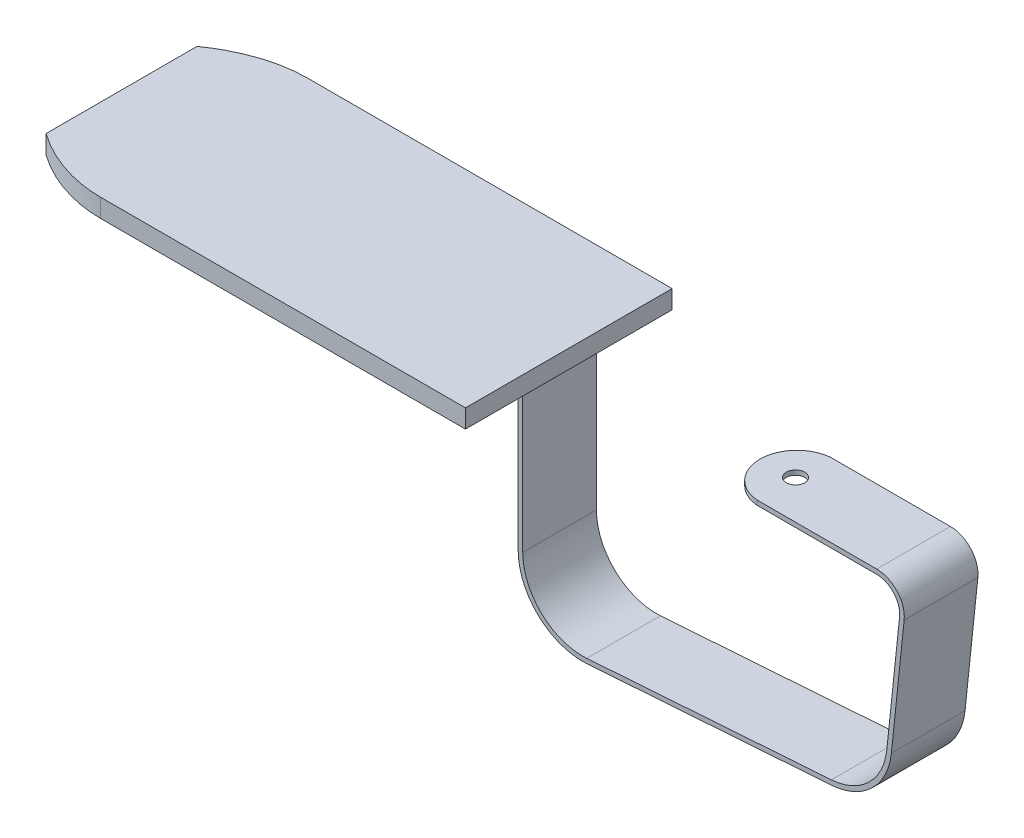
ISO-10303-21;
HEADER;
FILE_DESCRIPTION(('STEP AP214'),'2;1');
FILE_NAME('part.step','',(''),(''),'','','');
FILE_SCHEMA(('AUTOMOTIVE_DESIGN { 1 0 10303 214 1 1 1 1 }'));
ENDSEC;
DATA;
#1=APPLICATION_CONTEXT('core data for automotive mechanical design processes');
#2=APPLICATION_PROTOCOL_DEFINITION('international standard','automotive_design',2000,#1);
#3=PRODUCT_CONTEXT('',#1,'mechanical');
#4=PRODUCT('Part','Part','',(#3));
#5=PRODUCT_RELATED_PRODUCT_CATEGORY('part','',(#4));
#6=PRODUCT_DEFINITION_FORMATION('','',#4);
#7=PRODUCT_DEFINITION_CONTEXT('part definition',#1,'design');
#8=PRODUCT_DEFINITION('design','',#6,#7);
#9=PRODUCT_DEFINITION_SHAPE('','',#8);
#10=(LENGTH_UNIT() NAMED_UNIT(*) SI_UNIT(.MILLI.,.METRE.));
#11=(NAMED_UNIT(*) PLANE_ANGLE_UNIT() SI_UNIT($,.RADIAN.));
#12=(NAMED_UNIT(*) SI_UNIT($,.STERADIAN.) SOLID_ANGLE_UNIT());
#13=UNCERTAINTY_MEASURE_WITH_UNIT(LENGTH_MEASURE(1.E-05),#10,'distance_accuracy_value','');
#14=(GEOMETRIC_REPRESENTATION_CONTEXT(3) GLOBAL_UNCERTAINTY_ASSIGNED_CONTEXT((#13)) GLOBAL_UNIT_ASSIGNED_CONTEXT((#10,
#11,#12)) REPRESENTATION_CONTEXT('',''));
#15=CARTESIAN_POINT('',(0.,0.,0.));
#16=DIRECTION('',(0.,0.,1.));
#17=DIRECTION('',(1.,0.,0.));
#18=AXIS2_PLACEMENT_3D('',#15,#16,#17);
#19=CARTESIAN_POINT('',(109.183319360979,-3.86999999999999,5.08));
#20=DIRECTION('',(0.,0.,-1.));
#21=DIRECTION('',(-1.,0.,0.));
#22=AXIS2_PLACEMENT_3D('',#19,#20,#21);
#23=CYLINDRICAL_SURFACE('',#22,3.81);
#24=CARTESIAN_POINT('',(109.183319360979,-3.86999999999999,-5.08));
#25=DIRECTION('',(0.,0.,1.));
#26=DIRECTION('',(1.,0.,0.));
#27=AXIS2_PLACEMENT_3D('',#24,#25,#26);
#28=CIRCLE('',#27,3.81);
#29=CARTESIAN_POINT('',(112.972447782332,-4.26825344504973,-5.08));
#30=VERTEX_POINT('',#29);
#31=CARTESIAN_POINT('',(109.183319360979,-0.059999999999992,-5.08));
#32=VERTEX_POINT('',#31);
#33=EDGE_CURVE('E188',#30,#32,#28,.T.);
#34=ORIENTED_EDGE('',*,*,#33,.T.);
#35=DIRECTION('',(0.,0.,-1.));
#36=VECTOR('',#35,1.);
#37=CARTESIAN_POINT('',(109.183319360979,-0.059999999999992,5.08));
#38=LINE('',#37,#36);
#39=CARTESIAN_POINT('',(109.183319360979,-0.059999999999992,5.08));
#40=VERTEX_POINT('',#39);
#41=EDGE_CURVE('E51',#40,#32,#38,.T.);
#42=ORIENTED_EDGE('',*,*,#41,.F.);
#43=CARTESIAN_POINT('',(109.183319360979,-3.86999999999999,5.08));
#44=DIRECTION('',(0.,0.,1.));
#45=DIRECTION('',(1.,0.,0.));
#46=AXIS2_PLACEMENT_3D('',#43,#44,#45);
#47=CIRCLE('',#46,3.81);
#48=CARTESIAN_POINT('',(112.972447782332,-4.26825344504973,5.08));
#49=VERTEX_POINT('',#48);
#50=EDGE_CURVE('E220',#49,#40,#47,.T.);
#51=ORIENTED_EDGE('',*,*,#50,.F.);
#52=DIRECTION('',(0.,0.,-1.));
#53=VECTOR('',#52,1.);
#54=CARTESIAN_POINT('',(112.972447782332,-4.26825344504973,5.08));
#55=LINE('',#54,#53);
#56=EDGE_CURVE('E184',#49,#30,#55,.T.);
#57=ORIENTED_EDGE('',*,*,#56,.T.);
#58=EDGE_LOOP('',(#34,#42,#51,#57));
#59=FACE_BOUND('',#58,.T.);
#60=ADVANCED_FACE('F43',(#59),#23,.T.);
#61=CARTESIAN_POINT('',(109.183319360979,-0.059999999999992,5.08));
#62=DIRECTION('',(0.,-1.,0.));
#63=DIRECTION('',(1.,0.,0.));
#64=AXIS2_PLACEMENT_3D('',#61,#62,#63);
#65=PLANE('',#64);
#66=CARTESIAN_POINT('',(92.6606996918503,-0.0599999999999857,-0.259119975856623));
#67=DIRECTION('',(0.,1.,0.));
#68=DIRECTION('',(-1.,0.,0.));
#69=AXIS2_PLACEMENT_3D('',#66,#67,#68);
#70=ELLIPSE('',#69,1.27000000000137,1.26999408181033);
#71=CARTESIAN_POINT('',(91.390699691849,-0.0599999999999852,-0.259119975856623));
#72=VERTEX_POINT('',#71);
#73=EDGE_CURVE('E306',#72,#72,#70,.T.);
#74=ORIENTED_EDGE('',*,*,#73,.F.);
#75=EDGE_LOOP('',(#74));
#76=FACE_BOUND('',#75,.T.);
#77=DIRECTION('',(-1.,0.,0.));
#78=VECTOR('',#77,1.);
#79=CARTESIAN_POINT('',(109.183319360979,-0.059999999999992,-5.08));
#80=LINE('',#79,#78);
#81=CARTESIAN_POINT('',(92.6606996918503,-0.0599999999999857,-5.08));
#82=VERTEX_POINT('',#81);
#83=EDGE_CURVE('E191',#32,#82,#80,.T.);
#84=ORIENTED_EDGE('',*,*,#83,.T.);
#85=CARTESIAN_POINT('',(93.1150290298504,-0.0599999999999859,0.));
#86=DIRECTION('',(0.,-1.,0.));
#87=DIRECTION('',(-1.,0.,0.));
#88=AXIS2_PLACEMENT_3D('',#85,#86,#87);
#89=CIRCLE('',#88,5.10027598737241);
#90=CARTESIAN_POINT('',(92.6606996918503,-0.0599999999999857,5.08));
#91=VERTEX_POINT('',#90);
#92=EDGE_CURVE('E58',#91,#82,#89,.T.);
#93=ORIENTED_EDGE('',*,*,#92,.F.);
#94=DIRECTION('',(-1.,0.,0.));
#95=VECTOR('',#94,1.);
#96=CARTESIAN_POINT('',(109.183319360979,-0.059999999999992,5.08));
#97=LINE('',#96,#95);
#98=EDGE_CURVE('E125',#40,#91,#97,.T.);
#99=ORIENTED_EDGE('',*,*,#98,.F.);
#100=ORIENTED_EDGE('',*,*,#41,.T.);
#101=EDGE_LOOP('',(#84,#93,#99,#100));
#102=FACE_BOUND('',#101,.T.);
#103=ADVANCED_FACE('F252',(#76,#102),#65,.F.);
#104=CARTESIAN_POINT('',(109.183319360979,-0.694999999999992,5.08));
#105=DIRECTION('',(0.,1.,0.));
#106=DIRECTION('',(0.,0.,1.));
#107=AXIS2_PLACEMENT_3D('',#104,#105,#106);
#108=PLANE('',#107);
#109=CARTESIAN_POINT('',(92.6606996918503,-0.694999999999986,-0.259119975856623));
#110=DIRECTION('',(0.,1.,0.));
#111=DIRECTION('',(-1.,0.,0.));
#112=AXIS2_PLACEMENT_3D('',#109,#110,#111);
#113=ELLIPSE('',#112,1.27000000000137,1.26999408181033);
#114=CARTESIAN_POINT('',(91.390699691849,-0.694999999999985,-0.259119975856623));
#115=VERTEX_POINT('',#114);
#116=EDGE_CURVE('E46',#115,#115,#113,.T.);
#117=ORIENTED_EDGE('',*,*,#116,.T.);
#118=EDGE_LOOP('',(#117));
#119=FACE_BOUND('',#118,.T.);
#120=DIRECTION('',(1.,0.,0.));
#121=VECTOR('',#120,1.);
#122=CARTESIAN_POINT('',(109.183319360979,-0.694999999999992,5.08));
#123=LINE('',#122,#121);
#124=CARTESIAN_POINT('',(92.6606996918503,-0.694999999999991,5.08));
#125=VERTEX_POINT('',#124);
#126=CARTESIAN_POINT('',(109.183319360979,-0.694999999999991,5.08));
#127=VERTEX_POINT('',#126);
#128=EDGE_CURVE('E268',#125,#127,#123,.T.);
#129=ORIENTED_EDGE('',*,*,#128,.F.);
#130=CARTESIAN_POINT('',(93.1150290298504,-0.694999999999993,0.));
#131=DIRECTION('',(0.,1.,0.));
#132=DIRECTION('',(0.,0.,1.));
#133=AXIS2_PLACEMENT_3D('',#130,#131,#132);
#134=CIRCLE('',#133,5.10027598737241);
#135=CARTESIAN_POINT('',(92.6606996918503,-0.694999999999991,-5.08));
#136=VERTEX_POINT('',#135);
#137=EDGE_CURVE('E192',#125,#136,#134,.F.);
#138=ORIENTED_EDGE('',*,*,#137,.T.);
#139=DIRECTION('',(1.,0.,0.));
#140=VECTOR('',#139,1.);
#141=CARTESIAN_POINT('',(109.183319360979,-0.694999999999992,-5.08));
#142=LINE('',#141,#140);
#143=CARTESIAN_POINT('',(109.183319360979,-0.694999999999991,-5.08));
#144=VERTEX_POINT('',#143);
#145=EDGE_CURVE('E195',#136,#144,#142,.T.);
#146=ORIENTED_EDGE('',*,*,#145,.T.);
#147=DIRECTION('',(0.,0.,-1.));
#148=VECTOR('',#147,1.);
#149=CARTESIAN_POINT('',(109.183319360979,-0.694999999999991,5.08));
#150=LINE('',#149,#148);
#151=EDGE_CURVE('E248',#127,#144,#150,.T.);
#152=ORIENTED_EDGE('',*,*,#151,.F.);
#153=EDGE_LOOP('',(#129,#138,#146,#152));
#154=FACE_BOUND('',#153,.T.);
#155=ADVANCED_FACE('F266',(#119,#154),#108,.F.);
#156=CARTESIAN_POINT('',(109.183319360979,-3.86999999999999,5.08));
#157=DIRECTION('',(0.,0.,-1.));
#158=DIRECTION('',(-1.,0.,0.));
#159=AXIS2_PLACEMENT_3D('',#156,#157,#158);
#160=CYLINDRICAL_SURFACE('',#159,3.175);
#161=CARTESIAN_POINT('',(109.183319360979,-3.86999999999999,-5.08));
#162=DIRECTION('',(0.,0.,-1.));
#163=DIRECTION('',(1.,0.,0.));
#164=AXIS2_PLACEMENT_3D('',#161,#162,#163);
#165=CIRCLE('',#164,3.175);
#166=CARTESIAN_POINT('',(112.340926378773,-4.20187787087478,-5.08));
#167=VERTEX_POINT('',#166);
#168=EDGE_CURVE('E197',#144,#167,#165,.T.);
#169=ORIENTED_EDGE('',*,*,#168,.T.);
#170=DIRECTION('',(0.,0.,-1.));
#171=VECTOR('',#170,1.);
#172=CARTESIAN_POINT('',(112.340926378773,-4.20187787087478,5.08));
#173=LINE('',#172,#171);
#174=CARTESIAN_POINT('',(112.340926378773,-4.20187787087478,5.08));
#175=VERTEX_POINT('',#174);
#176=EDGE_CURVE('E245',#175,#167,#173,.T.);
#177=ORIENTED_EDGE('',*,*,#176,.F.);
#178=CARTESIAN_POINT('',(109.183319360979,-3.86999999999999,5.08));
#179=DIRECTION('',(0.,0.,-1.));
#180=DIRECTION('',(1.,0.,0.));
#181=AXIS2_PLACEMENT_3D('',#178,#179,#180);
#182=CIRCLE('',#181,3.175);
#183=EDGE_CURVE('E277',#127,#175,#182,.T.);
#184=ORIENTED_EDGE('',*,*,#183,.F.);
#185=ORIENTED_EDGE('',*,*,#151,.T.);
#186=EDGE_LOOP('',(#169,#177,#184,#185));
#187=FACE_BOUND('',#186,.T.);
#188=ADVANCED_FACE('F355',(#187),#160,.F.);
#189=CARTESIAN_POINT('',(110.577972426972,-20.9752642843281,5.08));
#190=DIRECTION('',(0.994521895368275,-0.10452846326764,0.));
#191=DIRECTION('',(0.10452846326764,0.994521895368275,0.));
#192=AXIS2_PLACEMENT_3D('',#189,#190,#191);
#193=PLANE('',#192);
#194=DIRECTION('',(-0.10452846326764,-0.994521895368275,0.));
#195=VECTOR('',#194,1.);
#196=CARTESIAN_POINT('',(110.577972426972,-20.9752642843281,-5.08));
#197=LINE('',#196,#195);
#198=CARTESIAN_POINT('',(110.577972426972,-20.9752642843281,-5.08));
#199=VERTEX_POINT('',#198);
#200=EDGE_CURVE('E199',#167,#199,#197,.T.);
#201=ORIENTED_EDGE('',*,*,#200,.T.);
#202=DIRECTION('',(0.,0.,-1.));
#203=VECTOR('',#202,1.);
#204=CARTESIAN_POINT('',(110.577972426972,-20.9752642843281,5.08));
#205=LINE('',#204,#203);
#206=CARTESIAN_POINT('',(110.577972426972,-20.9752642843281,5.08));
#207=VERTEX_POINT('',#206);
#208=EDGE_CURVE('E242',#207,#199,#205,.T.);
#209=ORIENTED_EDGE('',*,*,#208,.F.);
#210=DIRECTION('',(-0.10452846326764,-0.994521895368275,0.));
#211=VECTOR('',#210,1.);
#212=CARTESIAN_POINT('',(110.577972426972,-20.9752642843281,5.08));
#213=LINE('',#212,#211);
#214=EDGE_CURVE('E279',#175,#207,#213,.T.);
#215=ORIENTED_EDGE('',*,*,#214,.F.);
#216=ORIENTED_EDGE('',*,*,#176,.T.);
#217=EDGE_LOOP('',(#201,#209,#215,#216));
#218=FACE_BOUND('',#217,.T.);
#219=ADVANCED_FACE('F351',(#218),#193,.F.);
#220=CARTESIAN_POINT('',(102.368194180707,-20.1123818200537,5.08));
#221=DIRECTION('',(0.,0.,-1.));
#222=DIRECTION('',(-1.,0.,0.));
#223=AXIS2_PLACEMENT_3D('',#220,#221,#222);
#224=CYLINDRICAL_SURFACE('',#223,8.255);
#225=CARTESIAN_POINT('',(102.368194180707,-20.1123818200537,-5.08));
#226=DIRECTION('',(0.,0.,-1.));
#227=DIRECTION('',(1.,0.,0.));
#228=AXIS2_PLACEMENT_3D('',#225,#226,#227);
#229=CIRCLE('',#228,8.255);
#230=CARTESIAN_POINT('',(102.944033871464,-28.3472730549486,-5.08));
#231=VERTEX_POINT('',#230);
#232=EDGE_CURVE('E201',#199,#231,#229,.T.);
#233=ORIENTED_EDGE('',*,*,#232,.T.);
#234=DIRECTION('',(0.,0.,-1.));
#235=VECTOR('',#234,1.);
#236=CARTESIAN_POINT('',(102.944033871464,-28.3472730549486,5.08));
#237=LINE('',#236,#235);
#238=CARTESIAN_POINT('',(102.944033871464,-28.3472730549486,5.08));
#239=VERTEX_POINT('',#238);
#240=EDGE_CURVE('E239',#239,#231,#237,.T.);
#241=ORIENTED_EDGE('',*,*,#240,.F.);
#242=CARTESIAN_POINT('',(102.368194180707,-20.1123818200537,5.08));
#243=DIRECTION('',(0.,0.,-1.));
#244=DIRECTION('',(1.,0.,0.));
#245=AXIS2_PLACEMENT_3D('',#242,#243,#244);
#246=CIRCLE('',#245,8.255);
#247=EDGE_CURVE('E281',#207,#239,#246,.T.);
#248=ORIENTED_EDGE('',*,*,#247,.F.);
#249=ORIENTED_EDGE('',*,*,#208,.T.);
#250=EDGE_LOOP('',(#233,#241,#248,#249));
#251=FACE_BOUND('',#250,.T.);
#252=ADVANCED_FACE('F347',(#251),#224,.F.);
#253=CARTESIAN_POINT('',(69.2193396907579,-30.7055334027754,5.08));
#254=DIRECTION('',(0.0697564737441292,-0.997564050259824,0.));
#255=DIRECTION('',(0.997564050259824,0.0697564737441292,0.));
#256=AXIS2_PLACEMENT_3D('',#253,#254,#255);
#257=PLANE('',#256);
#258=DIRECTION('',(-0.997564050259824,-0.0697564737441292,0.));
#259=VECTOR('',#258,1.);
#260=CARTESIAN_POINT('',(69.2193396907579,-30.7055334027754,-5.08));
#261=LINE('',#260,#259);
#262=CARTESIAN_POINT('',(69.2193396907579,-30.7055334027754,-5.08));
#263=VERTEX_POINT('',#262);
#264=EDGE_CURVE('E203',#231,#263,#261,.T.);
#265=ORIENTED_EDGE('',*,*,#264,.T.);
#266=DIRECTION('',(0.,0.,-1.));
#267=VECTOR('',#266,1.);
#268=CARTESIAN_POINT('',(69.2193396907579,-30.7055334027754,5.08));
#269=LINE('',#268,#267);
#270=CARTESIAN_POINT('',(69.2193396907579,-30.7055334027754,5.08));
#271=VERTEX_POINT('',#270);
#272=EDGE_CURVE('E236',#271,#263,#269,.T.);
#273=ORIENTED_EDGE('',*,*,#272,.F.);
#274=DIRECTION('',(-0.997564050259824,-0.0697564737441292,0.));
#275=VECTOR('',#274,1.);
#276=CARTESIAN_POINT('',(69.2193396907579,-30.7055334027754,5.08));
#277=LINE('',#276,#275);
#278=EDGE_CURVE('E283',#239,#271,#277,.T.);
#279=ORIENTED_EDGE('',*,*,#278,.F.);
#280=ORIENTED_EDGE('',*,*,#240,.T.);
#281=EDGE_LOOP('',(#265,#273,#279,#280));
#282=FACE_BOUND('',#281,.T.);
#283=ADVANCED_FACE('F343',(#282),#257,.F.);
#284=CARTESIAN_POINT('',(68.6435,-22.4706421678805,5.08));
#285=DIRECTION('',(0.,0.,-1.));
#286=DIRECTION('',(-1.,0.,0.));
#287=AXIS2_PLACEMENT_3D('',#284,#285,#286);
#288=CYLINDRICAL_SURFACE('',#287,8.255);
#289=CARTESIAN_POINT('',(68.6435,-22.4706421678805,-5.08));
#290=DIRECTION('',(0.,0.,-1.));
#291=DIRECTION('',(-1.,0.,0.));
#292=AXIS2_PLACEMENT_3D('',#289,#290,#291);
#293=CIRCLE('',#292,8.255);
#294=CARTESIAN_POINT('',(60.3885,-22.4706421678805,-5.08));
#295=VERTEX_POINT('',#294);
#296=EDGE_CURVE('E205',#263,#295,#293,.T.);
#297=ORIENTED_EDGE('',*,*,#296,.T.);
#298=DIRECTION('',(0.,0.,-1.));
#299=VECTOR('',#298,1.);
#300=CARTESIAN_POINT('',(60.3885,-22.4706421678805,5.08));
#301=LINE('',#300,#299);
#302=CARTESIAN_POINT('',(60.3885,-22.4706421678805,5.08));
#303=VERTEX_POINT('',#302);
#304=EDGE_CURVE('E233',#303,#295,#301,.T.);
#305=ORIENTED_EDGE('',*,*,#304,.F.);
#306=CARTESIAN_POINT('',(68.6435,-22.4706421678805,5.08));
#307=DIRECTION('',(0.,0.,-1.));
#308=DIRECTION('',(-1.,0.,0.));
#309=AXIS2_PLACEMENT_3D('',#306,#307,#308);
#310=CIRCLE('',#309,8.255);
#311=EDGE_CURVE('E285',#271,#303,#310,.T.);
#312=ORIENTED_EDGE('',*,*,#311,.F.);
#313=ORIENTED_EDGE('',*,*,#272,.T.);
#314=EDGE_LOOP('',(#297,#305,#312,#313));
#315=FACE_BOUND('',#314,.T.);
#316=ADVANCED_FACE('F339',(#315),#288,.F.);
#317=CARTESIAN_POINT('',(60.3885,-3.175,5.08));
#318=DIRECTION('',(-1.,0.,0.));
#319=DIRECTION('',(0.,-1.,0.));
#320=AXIS2_PLACEMENT_3D('',#317,#318,#319);
#321=PLANE('',#320);
#322=DIRECTION('',(0.,1.,0.));
#323=VECTOR('',#322,1.);
#324=CARTESIAN_POINT('',(60.3885,-3.175,-5.08));
#325=LINE('',#324,#323);
#326=CARTESIAN_POINT('',(60.3885,-2.54,-5.08));
#327=VERTEX_POINT('',#326);
#328=EDGE_CURVE('E208',#295,#327,#325,.T.);
#329=ORIENTED_EDGE('',*,*,#328,.T.);
#330=DIRECTION('',(0.,0.,-1.));
#331=VECTOR('',#330,1.);
#332=CARTESIAN_POINT('',(60.3885,-2.54,5.08));
#333=LINE('',#332,#331);
#334=CARTESIAN_POINT('',(60.3885,-2.54,5.08));
#335=VERTEX_POINT('',#334);
#336=EDGE_CURVE('E230',#335,#327,#333,.T.);
#337=ORIENTED_EDGE('',*,*,#336,.F.);
#338=DIRECTION('',(0.,1.,0.));
#339=VECTOR('',#338,1.);
#340=CARTESIAN_POINT('',(60.3885,-3.175,5.08));
#341=LINE('',#340,#339);
#342=EDGE_CURVE('E287',#303,#335,#341,.T.);
#343=ORIENTED_EDGE('',*,*,#342,.F.);
#344=ORIENTED_EDGE('',*,*,#304,.T.);
#345=EDGE_LOOP('',(#329,#337,#343,#344));
#346=FACE_BOUND('',#345,.T.);
#347=ADVANCED_FACE('F335',(#346),#321,.F.);
#348=CARTESIAN_POINT('',(59.7535,-2.54,5.08));
#349=DIRECTION('',(0.,-1.,0.));
#350=DIRECTION('',(0.,0.,-1.));
#351=AXIS2_PLACEMENT_3D('',#348,#349,#350);
#352=PLANE('',#351);
#353=DIRECTION('',(-1.,0.,0.));
#354=VECTOR('',#353,1.);
#355=CARTESIAN_POINT('',(59.7535,-2.54,-5.08));
#356=LINE('',#355,#354);
#357=CARTESIAN_POINT('',(59.7535,-2.54,-5.08));
#358=VERTEX_POINT('',#357);
#359=EDGE_CURVE('E210',#327,#358,#356,.T.);
#360=ORIENTED_EDGE('',*,*,#359,.T.);
#361=DIRECTION('',(0.,0.,-1.));
#362=VECTOR('',#361,1.);
#363=CARTESIAN_POINT('',(59.7535,-2.54,5.08));
#364=LINE('',#363,#362);
#365=CARTESIAN_POINT('',(59.7535,-2.54,5.08));
#366=VERTEX_POINT('',#365);
#367=EDGE_CURVE('E227',#366,#358,#364,.T.);
#368=ORIENTED_EDGE('',*,*,#367,.F.);
#369=DIRECTION('',(-1.,0.,0.));
#370=VECTOR('',#369,1.);
#371=CARTESIAN_POINT('',(59.7535,-2.54,5.08));
#372=LINE('',#371,#370);
#373=EDGE_CURVE('E289',#335,#366,#372,.T.);
#374=ORIENTED_EDGE('',*,*,#373,.F.);
#375=ORIENTED_EDGE('',*,*,#336,.T.);
#376=EDGE_LOOP('',(#360,#368,#374,#375));
#377=FACE_BOUND('',#376,.T.);
#378=ADVANCED_FACE('F332',(#377),#352,.F.);
#379=CARTESIAN_POINT('',(59.7535,-2.54,5.08));
#380=DIRECTION('',(1.,0.,0.));
#381=DIRECTION('',(0.,1.,0.));
#382=AXIS2_PLACEMENT_3D('',#379,#380,#381);
#383=PLANE('',#382);
#384=DIRECTION('',(0.,-1.,0.));
#385=VECTOR('',#384,1.);
#386=CARTESIAN_POINT('',(59.7535,-2.54,-5.08));
#387=LINE('',#386,#385);
#388=CARTESIAN_POINT('',(59.7535,-22.4706421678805,-5.08));
#389=VERTEX_POINT('',#388);
#390=EDGE_CURVE('E212',#358,#389,#387,.T.);
#391=ORIENTED_EDGE('',*,*,#390,.T.);
#392=DIRECTION('',(0.,0.,-1.));
#393=VECTOR('',#392,1.);
#394=CARTESIAN_POINT('',(59.7535,-22.4706421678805,5.08));
#395=LINE('',#394,#393);
#396=CARTESIAN_POINT('',(59.7535,-22.4706421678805,5.08));
#397=VERTEX_POINT('',#396);
#398=EDGE_CURVE('E224',#397,#389,#395,.T.);
#399=ORIENTED_EDGE('',*,*,#398,.F.);
#400=DIRECTION('',(0.,-1.,0.));
#401=VECTOR('',#400,1.);
#402=CARTESIAN_POINT('',(59.7535,-2.54,5.08));
#403=LINE('',#402,#401);
#404=EDGE_CURVE('E291',#366,#397,#403,.T.);
#405=ORIENTED_EDGE('',*,*,#404,.F.);
#406=ORIENTED_EDGE('',*,*,#367,.T.);
#407=EDGE_LOOP('',(#391,#399,#405,#406));
#408=FACE_BOUND('',#407,.T.);
#409=ADVANCED_FACE('F297',(#408),#383,.F.);
#410=CARTESIAN_POINT('',(68.6435,-22.4706421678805,5.08));
#411=DIRECTION('',(0.,0.,-1.));
#412=DIRECTION('',(-1.,0.,0.));
#413=AXIS2_PLACEMENT_3D('',#410,#411,#412);
#414=CYLINDRICAL_SURFACE('',#413,8.89);
#415=CARTESIAN_POINT('',(68.6435,-22.4706421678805,-5.08));
#416=DIRECTION('',(0.,0.,1.));
#417=DIRECTION('',(-1.,0.,0.));
#418=AXIS2_PLACEMENT_3D('',#415,#416,#417);
#419=CIRCLE('',#418,8.89);
#420=CARTESIAN_POINT('',(69.2636350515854,-31.3389865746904,-5.08));
#421=VERTEX_POINT('',#420);
#422=EDGE_CURVE('E214',#389,#421,#419,.T.);
#423=ORIENTED_EDGE('',*,*,#422,.T.);
#424=DIRECTION('',(0.,0.,-1.));
#425=VECTOR('',#424,1.);
#426=CARTESIAN_POINT('',(69.2636350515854,-31.3389865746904,5.08));
#427=LINE('',#426,#425);
#428=CARTESIAN_POINT('',(69.2636350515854,-31.3389865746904,5.08));
#429=VERTEX_POINT('',#428);
#430=EDGE_CURVE('E179',#429,#421,#427,.T.);
#431=ORIENTED_EDGE('',*,*,#430,.F.);
#432=CARTESIAN_POINT('',(68.6435,-22.4706421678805,5.08));
#433=DIRECTION('',(0.,0.,1.));
#434=DIRECTION('',(-1.,0.,0.));
#435=AXIS2_PLACEMENT_3D('',#432,#433,#434);
#436=CIRCLE('',#435,8.89);
#437=EDGE_CURVE('E167',#397,#429,#436,.T.);
#438=ORIENTED_EDGE('',*,*,#437,.F.);
#439=ORIENTED_EDGE('',*,*,#398,.T.);
#440=EDGE_LOOP('',(#423,#431,#438,#439));
#441=FACE_BOUND('',#440,.T.);
#442=ADVANCED_FACE('F301',(#441),#414,.T.);
#443=CARTESIAN_POINT('',(69.2636350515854,-31.3389865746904,5.08));
#444=DIRECTION('',(-0.0697564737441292,0.997564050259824,0.));
#445=DIRECTION('',(-0.997564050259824,-0.0697564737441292,0.));
#446=AXIS2_PLACEMENT_3D('',#443,#444,#445);
#447=PLANE('',#446);
#448=DIRECTION('',(0.997564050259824,0.0697564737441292,0.));
#449=VECTOR('',#448,1.);
#450=CARTESIAN_POINT('',(69.2636350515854,-31.3389865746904,-5.08));
#451=LINE('',#450,#449);
#452=CARTESIAN_POINT('',(102.988329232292,-28.9807262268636,-5.08));
#453=VERTEX_POINT('',#452);
#454=EDGE_CURVE('E176',#421,#453,#451,.T.);
#455=ORIENTED_EDGE('',*,*,#454,.T.);
#456=DIRECTION('',(0.,0.,-1.));
#457=VECTOR('',#456,1.);
#458=CARTESIAN_POINT('',(102.988329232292,-28.9807262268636,5.08));
#459=LINE('',#458,#457);
#460=CARTESIAN_POINT('',(102.988329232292,-28.9807262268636,5.08));
#461=VERTEX_POINT('',#460);
#462=EDGE_CURVE('E173',#461,#453,#459,.T.);
#463=ORIENTED_EDGE('',*,*,#462,.F.);
#464=DIRECTION('',(0.997564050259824,0.0697564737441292,0.));
#465=VECTOR('',#464,1.);
#466=CARTESIAN_POINT('',(69.2636350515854,-31.3389865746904,5.08));
#467=LINE('',#466,#465);
#468=EDGE_CURVE('E159',#429,#461,#467,.T.);
#469=ORIENTED_EDGE('',*,*,#468,.F.);
#470=ORIENTED_EDGE('',*,*,#430,.T.);
#471=EDGE_LOOP('',(#455,#463,#469,#470));
#472=FACE_BOUND('',#471,.T.);
#473=ADVANCED_FACE('F174',(#472),#447,.F.);
#474=CARTESIAN_POINT('',(102.368194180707,-20.1123818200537,5.08));
#475=DIRECTION('',(0.,0.,-1.));
#476=DIRECTION('',(-1.,0.,0.));
#477=AXIS2_PLACEMENT_3D('',#474,#475,#476);
#478=CYLINDRICAL_SURFACE('',#477,8.89);
#479=CARTESIAN_POINT('',(102.368194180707,-20.1123818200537,-5.08));
#480=DIRECTION('',(0.,0.,1.));
#481=DIRECTION('',(1.,0.,0.));
#482=AXIS2_PLACEMENT_3D('',#479,#480,#481);
#483=CIRCLE('',#482,8.89);
#484=CARTESIAN_POINT('',(111.20949383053,-21.041639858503,-5.08));
#485=VERTEX_POINT('',#484);
#486=EDGE_CURVE('E217',#453,#485,#483,.T.);
#487=ORIENTED_EDGE('',*,*,#486,.T.);
#488=DIRECTION('',(0.,0.,-1.));
#489=VECTOR('',#488,1.);
#490=CARTESIAN_POINT('',(111.20949383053,-21.041639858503,5.08));
#491=LINE('',#490,#489);
#492=CARTESIAN_POINT('',(111.20949383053,-21.041639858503,5.08));
#493=VERTEX_POINT('',#492);
#494=EDGE_CURVE('E180',#493,#485,#491,.T.);
#495=ORIENTED_EDGE('',*,*,#494,.F.);
#496=CARTESIAN_POINT('',(102.368194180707,-20.1123818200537,5.08));
#497=DIRECTION('',(0.,0.,1.));
#498=DIRECTION('',(1.,0.,0.));
#499=AXIS2_PLACEMENT_3D('',#496,#497,#498);
#500=CIRCLE('',#499,8.89);
#501=EDGE_CURVE('E164',#461,#493,#500,.T.);
#502=ORIENTED_EDGE('',*,*,#501,.F.);
#503=ORIENTED_EDGE('',*,*,#462,.T.);
#504=EDGE_LOOP('',(#487,#495,#502,#503));
#505=FACE_BOUND('',#504,.T.);
#506=ADVANCED_FACE('F182',(#505),#478,.T.);
#507=CARTESIAN_POINT('',(111.20949383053,-21.041639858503,5.08));
#508=DIRECTION('',(-0.994521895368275,0.10452846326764,0.));
#509=DIRECTION('',(-0.10452846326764,-0.994521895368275,0.));
#510=AXIS2_PLACEMENT_3D('',#507,#508,#509);
#511=PLANE('',#510);
#512=DIRECTION('',(0.10452846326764,0.994521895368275,0.));
#513=VECTOR('',#512,1.);
#514=CARTESIAN_POINT('',(111.20949383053,-21.041639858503,-5.08));
#515=LINE('',#514,#513);
#516=EDGE_CURVE('E117',#485,#30,#515,.T.);
#517=ORIENTED_EDGE('',*,*,#516,.T.);
#518=ORIENTED_EDGE('',*,*,#56,.F.);
#519=DIRECTION('',(0.10452846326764,0.994521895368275,0.));
#520=VECTOR('',#519,1.);
#521=CARTESIAN_POINT('',(111.20949383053,-21.041639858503,5.08));
#522=LINE('',#521,#520);
#523=EDGE_CURVE('E66',#493,#49,#522,.T.);
#524=ORIENTED_EDGE('',*,*,#523,.F.);
#525=ORIENTED_EDGE('',*,*,#494,.T.);
#526=EDGE_LOOP('',(#517,#518,#524,#525));
#527=FACE_BOUND('',#526,.T.);
#528=ADVANCED_FACE('F302',(#527),#511,.F.);
#529=CARTESIAN_POINT('',(109.183319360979,-3.86999999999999,5.08));
#530=DIRECTION('',(0.,0.,1.));
#531=DIRECTION('',(1.,0.,0.));
#532=AXIS2_PLACEMENT_3D('',#529,#530,#531);
#533=PLANE('',#532);
#534=DIRECTION('',(0.,1.,0.));
#535=VECTOR('',#534,1.);
#536=CARTESIAN_POINT('',(92.6606996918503,-10.22,5.08));
#537=LINE('',#536,#535);
#538=EDGE_CURVE('E269',#125,#91,#537,.T.);
#539=ORIENTED_EDGE('',*,*,#538,.F.);
#540=ORIENTED_EDGE('',*,*,#128,.T.);
#541=ORIENTED_EDGE('',*,*,#183,.T.);
#542=ORIENTED_EDGE('',*,*,#214,.T.);
#543=ORIENTED_EDGE('',*,*,#247,.T.);
#544=ORIENTED_EDGE('',*,*,#278,.T.);
#545=ORIENTED_EDGE('',*,*,#311,.T.);
#546=ORIENTED_EDGE('',*,*,#342,.T.);
#547=ORIENTED_EDGE('',*,*,#373,.T.);
#548=ORIENTED_EDGE('',*,*,#404,.T.);
#549=ORIENTED_EDGE('',*,*,#437,.T.);
#550=ORIENTED_EDGE('',*,*,#468,.T.);
#551=ORIENTED_EDGE('',*,*,#501,.T.);
#552=ORIENTED_EDGE('',*,*,#523,.T.);
#553=ORIENTED_EDGE('',*,*,#50,.T.);
#554=ORIENTED_EDGE('',*,*,#98,.T.);
#555=EDGE_LOOP('',(#539,#540,#541,#542,#543,#544,#545,#546,#547,#548,#549,#550,#551,#552,#553,#554));
#556=FACE_BOUND('',#555,.T.);
#557=ADVANCED_FACE('F162',(#556),#533,.T.);
#558=CARTESIAN_POINT('',(109.183319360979,-3.86999999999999,-5.08));
#559=DIRECTION('',(0.,0.,1.));
#560=DIRECTION('',(1.,0.,0.));
#561=AXIS2_PLACEMENT_3D('',#558,#559,#560);
#562=PLANE('',#561);
#563=ORIENTED_EDGE('',*,*,#145,.F.);
#564=DIRECTION('',(0.,1.,0.));
#565=VECTOR('',#564,1.);
#566=CARTESIAN_POINT('',(92.6606996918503,-10.22,-5.08));
#567=LINE('',#566,#565);
#568=EDGE_CURVE('E12',#136,#82,#567,.T.);
#569=ORIENTED_EDGE('',*,*,#568,.T.);
#570=ORIENTED_EDGE('',*,*,#83,.F.);
#571=ORIENTED_EDGE('',*,*,#33,.F.);
#572=ORIENTED_EDGE('',*,*,#516,.F.);
#573=ORIENTED_EDGE('',*,*,#486,.F.);
#574=ORIENTED_EDGE('',*,*,#454,.F.);
#575=ORIENTED_EDGE('',*,*,#422,.F.);
#576=ORIENTED_EDGE('',*,*,#390,.F.);
#577=ORIENTED_EDGE('',*,*,#359,.F.);
#578=ORIENTED_EDGE('',*,*,#328,.F.);
#579=ORIENTED_EDGE('',*,*,#296,.F.);
#580=ORIENTED_EDGE('',*,*,#264,.F.);
#581=ORIENTED_EDGE('',*,*,#232,.F.);
#582=ORIENTED_EDGE('',*,*,#200,.F.);
#583=ORIENTED_EDGE('',*,*,#168,.F.);
#584=EDGE_LOOP('',(#563,#569,#570,#571,#572,#573,#574,#575,#576,#577,#578,#579,#580,#581,#582,#583));
#585=FACE_BOUND('',#584,.T.);
#586=ADVANCED_FACE('F258',(#585),#562,.F.);
#587=CARTESIAN_POINT('',(93.1150290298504,-10.22,0.));
#588=DIRECTION('',(0.,1.,0.));
#589=DIRECTION('',(-1.,0.,0.));
#590=AXIS2_PLACEMENT_3D('',#587,#588,#589);
#591=CYLINDRICAL_SURFACE('',#590,5.10027598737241);
#592=ORIENTED_EDGE('',*,*,#92,.T.);
#593=ORIENTED_EDGE('',*,*,#568,.F.);
#594=ORIENTED_EDGE('',*,*,#137,.F.);
#595=ORIENTED_EDGE('',*,*,#538,.T.);
#596=EDGE_LOOP('',(#592,#593,#594,#595));
#597=FACE_BOUND('',#596,.T.);
#598=ADVANCED_FACE('F262',(#597),#591,.T.);
#599=CARTESIAN_POINT('',(92.6606996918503,-10.22,-0.259119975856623));
#600=DIRECTION('',(0.,1.,0.));
#601=DIRECTION('',(-1.,0.,0.));
#602=AXIS2_PLACEMENT_3D('',#599,#600,#601);
#603=ELLIPSE('',#602,1.27000000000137,1.26999408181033);
#604=DIRECTION('',(0.,1.,0.));
#605=VECTOR('',#604,1.);
#606=SURFACE_OF_LINEAR_EXTRUSION('',#603,#605);
#607=ORIENTED_EDGE('',*,*,#73,.T.);
#608=EDGE_LOOP('',(#607));
#609=FACE_BOUND('',#608,.T.);
#610=ORIENTED_EDGE('',*,*,#116,.F.);
#611=EDGE_LOOP('',(#610));
#612=FACE_BOUND('',#611,.T.);
#613=ADVANCED_FACE('F312',(#609,#612),#606,.F.);
#614=CLOSED_SHELL('',(#60,#103,#155,#188,#219,#252,#283,#316,#347,#378,#409,#442,#473,#506,#528,
#557,#586,#598,#613));
#615=MANIFOLD_SOLID_BREP('B2',#614);
#616=CARTESIAN_POINT('',(61.6585,-2.54,14.24305));
#617=DIRECTION('',(1.,0.,0.));
#618=DIRECTION('',(0.,0.,-1.));
#619=AXIS2_PLACEMENT_3D('',#616,#617,#618);
#620=PLANE('',#619);
#621=DIRECTION('',(0.,0.,-1.));
#622=VECTOR('',#621,1.);
#623=CARTESIAN_POINT('',(61.6585,0.,14.24305));
#624=LINE('',#623,#622);
#625=CARTESIAN_POINT('',(61.6585,0.,14.24305));
#626=VERTEX_POINT('',#625);
#627=CARTESIAN_POINT('',(61.6585,0.,-14.24305));
#628=VERTEX_POINT('',#627);
#629=EDGE_CURVE('E701',#626,#628,#624,.T.);
#630=ORIENTED_EDGE('',*,*,#629,.F.);
#631=DIRECTION('',(0.,1.,0.));
#632=VECTOR('',#631,1.);
#633=CARTESIAN_POINT('',(61.6585,-2.54,14.24305));
#634=LINE('',#633,#632);
#635=CARTESIAN_POINT('',(61.6585,-2.54,14.24305));
#636=VERTEX_POINT('',#635);
#637=EDGE_CURVE('E41',#636,#626,#634,.T.);
#638=ORIENTED_EDGE('',*,*,#637,.F.);
#639=DIRECTION('',(0.,0.,-1.));
#640=VECTOR('',#639,1.);
#641=CARTESIAN_POINT('',(61.6585,-2.54,14.24305));
#642=LINE('',#641,#640);
#643=CARTESIAN_POINT('',(61.6585,-2.54,-14.24305));
#644=VERTEX_POINT('',#643);
#645=EDGE_CURVE('E724',#636,#644,#642,.T.);
#646=ORIENTED_EDGE('',*,*,#645,.T.);
#647=DIRECTION('',(0.,1.,0.));
#648=VECTOR('',#647,1.);
#649=CARTESIAN_POINT('',(61.6585,-2.54,-14.24305));
#650=LINE('',#649,#648);
#651=EDGE_CURVE('E772',#644,#628,#650,.T.);
#652=ORIENTED_EDGE('',*,*,#651,.T.);
#653=EDGE_LOOP('',(#630,#638,#646,#652));
#654=FACE_BOUND('',#653,.T.);
#655=ADVANCED_FACE('F507',(#654),#620,.T.);
#656=CARTESIAN_POINT('',(11.3531192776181,-2.54,14.24305));
#657=DIRECTION('',(0.,0.,1.));
#658=DIRECTION('',(1.,0.,0.));
#659=AXIS2_PLACEMENT_3D('',#656,#657,#658);
#660=PLANE('',#659);
#661=DIRECTION('',(1.,0.,0.));
#662=VECTOR('',#661,1.);
#663=CARTESIAN_POINT('',(11.3531192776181,0.,14.24305));
#664=LINE('',#663,#662);
#665=CARTESIAN_POINT('',(11.3531192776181,0.,14.24305));
#666=VERTEX_POINT('',#665);
#667=EDGE_CURVE('E728',#666,#626,#664,.T.);
#668=ORIENTED_EDGE('',*,*,#667,.F.);
#669=DIRECTION('',(0.,1.,0.));
#670=VECTOR('',#669,1.);
#671=CARTESIAN_POINT('',(11.3531192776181,-2.54,14.24305));
#672=LINE('',#671,#670);
#673=CARTESIAN_POINT('',(11.3531192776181,-2.54,14.24305));
#674=VERTEX_POINT('',#673);
#675=EDGE_CURVE('E517',#674,#666,#672,.T.);
#676=ORIENTED_EDGE('',*,*,#675,.F.);
#677=DIRECTION('',(1.,0.,0.));
#678=VECTOR('',#677,1.);
#679=CARTESIAN_POINT('',(11.3531192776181,-2.54,14.24305));
#680=LINE('',#679,#678);
#681=EDGE_CURVE('E796',#674,#636,#680,.T.);
#682=ORIENTED_EDGE('',*,*,#681,.T.);
#683=ORIENTED_EDGE('',*,*,#637,.T.);
#684=EDGE_LOOP('',(#668,#676,#682,#683));
#685=FACE_BOUND('',#684,.T.);
#686=ADVANCED_FACE('F760',(#685),#660,.T.);
#687=CARTESIAN_POINT('',(0.,-2.54,10.4086438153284));
#688=CARTESIAN_POINT('',(0.199362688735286,-2.54,10.5432337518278));
#689=CARTESIAN_POINT('',(0.58562500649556,-2.54,10.807716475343));
#690=CARTESIAN_POINT('',(1.45809376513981,-2.54,11.3739041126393));
#691=CARTESIAN_POINT('',(2.98477193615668,-2.54,12.238095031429));
#692=CARTESIAN_POINT('',(5.29074310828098,-2.54,13.2466904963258));
#693=CARTESIAN_POINT('',(8.26079143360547,-2.54,14.0463185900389));
#694=CARTESIAN_POINT('',(10.3250954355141,-2.54,14.24305));
#695=CARTESIAN_POINT('',(11.3531192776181,-2.54,14.24305));
#696=B_SPLINE_CURVE_WITH_KNOTS('',3,(#687,#688,#689,#690,#691,#692,#693,#694,#695),
.UNSPECIFIED.,.F.,.F.,(4,1,1,1,1,1,4),(-0.0623526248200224,0.00404441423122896,
0.0704414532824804,0.203235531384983,0.468823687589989,0.734411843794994,1.),.UNSPECIFIED.);
#697=DIRECTION('',(0.,1.,0.));
#698=VECTOR('',#697,1.);
#699=SURFACE_OF_LINEAR_EXTRUSION('',#696,#698);
#700=CARTESIAN_POINT('',(0.,0.,10.4086438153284));
#701=CARTESIAN_POINT('',(0.199362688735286,0.,10.5432337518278));
#702=CARTESIAN_POINT('',(0.58562500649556,0.,10.807716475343));
#703=CARTESIAN_POINT('',(1.45809376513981,0.,11.3739041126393));
#704=CARTESIAN_POINT('',(2.98477193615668,0.,12.238095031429));
#705=CARTESIAN_POINT('',(5.29074310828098,0.,13.2466904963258));
#706=CARTESIAN_POINT('',(8.26079143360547,0.,14.0463185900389));
#707=CARTESIAN_POINT('',(10.3250954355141,0.,14.24305));
#708=CARTESIAN_POINT('',(11.3531192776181,0.,14.24305));
#709=B_SPLINE_CURVE_WITH_KNOTS('',3,(#700,#701,#702,#703,#704,#705,#706,#707,#708),
.UNSPECIFIED.,.F.,.F.,(4,1,1,1,1,1,4),(-0.0623526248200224,0.00404441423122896,
0.0704414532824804,0.203235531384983,0.468823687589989,0.734411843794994,1.),.UNSPECIFIED.);
#710=CARTESIAN_POINT('',(0.,0.,10.4086438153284));
#711=VERTEX_POINT('',#710);
#712=EDGE_CURVE('E781',#711,#666,#709,.T.);
#713=ORIENTED_EDGE('',*,*,#712,.F.);
#714=DIRECTION('',(0.,1.,0.));
#715=VECTOR('',#714,1.);
#716=CARTESIAN_POINT('',(0.,-2.54,10.4086438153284));
#717=LINE('',#716,#715);
#718=CARTESIAN_POINT('',(0.,-2.54,10.4086438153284));
#719=VERTEX_POINT('',#718);
#720=EDGE_CURVE('E790',#719,#711,#717,.T.);
#721=ORIENTED_EDGE('',*,*,#720,.F.);
#722=EDGE_CURVE('E819',#719,#674,#696,.T.);
#723=ORIENTED_EDGE('',*,*,#722,.T.);
#724=ORIENTED_EDGE('',*,*,#675,.T.);
#725=EDGE_LOOP('',(#713,#721,#723,#724));
#726=FACE_BOUND('',#725,.T.);
#727=ADVANCED_FACE('F765',(#726),#699,.T.);
#728=CARTESIAN_POINT('',(0.,-2.54,-10.4086438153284));
#729=DIRECTION('',(-1.,0.,0.));
#730=DIRECTION('',(0.,0.,1.));
#731=AXIS2_PLACEMENT_3D('',#728,#729,#730);
#732=PLANE('',#731);
#733=DIRECTION('',(0.,0.,1.));
#734=VECTOR('',#733,1.);
#735=CARTESIAN_POINT('',(0.,0.,-10.4086438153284));
#736=LINE('',#735,#734);
#737=CARTESIAN_POINT('',(0.,0.,-10.4086438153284));
#738=VERTEX_POINT('',#737);
#739=EDGE_CURVE('E783',#738,#711,#736,.T.);
#740=ORIENTED_EDGE('',*,*,#739,.F.);
#741=DIRECTION('',(0.,1.,0.));
#742=VECTOR('',#741,1.);
#743=CARTESIAN_POINT('',(0.,-2.54,-10.4086438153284));
#744=LINE('',#743,#742);
#745=CARTESIAN_POINT('',(0.,-2.54,-10.4086438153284));
#746=VERTEX_POINT('',#745);
#747=EDGE_CURVE('E792',#746,#738,#744,.T.);
#748=ORIENTED_EDGE('',*,*,#747,.F.);
#749=DIRECTION('',(0.,0.,1.));
#750=VECTOR('',#749,1.);
#751=CARTESIAN_POINT('',(0.,-2.54,-10.4086438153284));
#752=LINE('',#751,#750);
#753=EDGE_CURVE('E737',#746,#719,#752,.T.);
#754=ORIENTED_EDGE('',*,*,#753,.T.);
#755=ORIENTED_EDGE('',*,*,#720,.T.);
#756=EDGE_LOOP('',(#740,#748,#754,#755));
#757=FACE_BOUND('',#756,.T.);
#758=ADVANCED_FACE('F747',(#757),#732,.T.);
#759=CARTESIAN_POINT('',(11.3531192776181,-2.54,-14.24305));
#760=CARTESIAN_POINT('',(10.3274505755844,-2.54,-14.24305));
#761=CARTESIAN_POINT('',(8.2683963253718,-2.54,-14.0472129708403));
#762=CARTESIAN_POINT('',(5.30246649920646,-2.54,-13.2511778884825));
#763=CARTESIAN_POINT('',(2.98491975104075,-2.54,-12.2384079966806));
#764=CARTESIAN_POINT('',(1.45756895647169,-2.54,-11.373573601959));
#765=CARTESIAN_POINT('',(0.585224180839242,-2.54,-10.8074429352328));
#766=CARTESIAN_POINT('',(0.199247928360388,-2.54,-10.5431562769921));
#767=CARTESIAN_POINT('',(0.,-2.54,-10.4086438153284));
#768=B_SPLINE_CURVE_WITH_KNOTS('',3,(#759,#760,#761,#762,#763,#764,#765,#766,#767),
.UNSPECIFIED.,.F.,.F.,(4,1,1,1,1,1,4),(0.,0.265597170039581,0.531194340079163,0.796791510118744,
0.929590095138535,0.99598938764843,1.06238868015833),.UNSPECIFIED.);
#769=DIRECTION('',(0.,1.,0.));
#770=VECTOR('',#769,1.);
#771=SURFACE_OF_LINEAR_EXTRUSION('',#768,#770);
#772=CARTESIAN_POINT('',(11.3531192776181,0.,-14.24305));
#773=CARTESIAN_POINT('',(10.3274505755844,0.,-14.24305));
#774=CARTESIAN_POINT('',(8.2683963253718,0.,-14.0472129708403));
#775=CARTESIAN_POINT('',(5.30246649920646,0.,-13.2511778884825));
#776=CARTESIAN_POINT('',(2.98491975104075,0.,-12.2384079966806));
#777=CARTESIAN_POINT('',(1.45756895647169,0.,-11.373573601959));
#778=CARTESIAN_POINT('',(0.585224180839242,0.,-10.8074429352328));
#779=CARTESIAN_POINT('',(0.199247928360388,0.,-10.5431562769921));
#780=CARTESIAN_POINT('',(0.,0.,-10.4086438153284));
#781=B_SPLINE_CURVE_WITH_KNOTS('',3,(#772,#773,#774,#775,#776,#777,#778,#779,#780),
.UNSPECIFIED.,.F.,.F.,(4,1,1,1,1,1,4),(0.,0.265597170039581,0.531194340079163,0.796791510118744,
0.929590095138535,0.99598938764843,1.06238868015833),.UNSPECIFIED.);
#782=CARTESIAN_POINT('',(11.3531192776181,0.,-14.24305));
#783=VERTEX_POINT('',#782);
#784=EDGE_CURVE('E831',#783,#738,#781,.T.);
#785=ORIENTED_EDGE('',*,*,#784,.F.);
#786=DIRECTION('',(0.,1.,0.));
#787=VECTOR('',#786,1.);
#788=CARTESIAN_POINT('',(11.3531192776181,-2.54,-14.24305));
#789=LINE('',#788,#787);
#790=CARTESIAN_POINT('',(11.3531192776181,-2.54,-14.24305));
#791=VERTEX_POINT('',#790);
#792=EDGE_CURVE('E794',#791,#783,#789,.T.);
#793=ORIENTED_EDGE('',*,*,#792,.F.);
#794=EDGE_CURVE('E731',#791,#746,#768,.T.);
#795=ORIENTED_EDGE('',*,*,#794,.T.);
#796=ORIENTED_EDGE('',*,*,#747,.T.);
#797=EDGE_LOOP('',(#785,#793,#795,#796));
#798=FACE_BOUND('',#797,.T.);
#799=ADVANCED_FACE('F743',(#798),#771,.T.);
#800=CARTESIAN_POINT('',(61.6585,-2.54,-14.24305));
#801=DIRECTION('',(0.,0.,-1.));
#802=DIRECTION('',(-1.,0.,0.));
#803=AXIS2_PLACEMENT_3D('',#800,#801,#802);
#804=PLANE('',#803);
#805=DIRECTION('',(-1.,0.,0.));
#806=VECTOR('',#805,1.);
#807=CARTESIAN_POINT('',(61.6585,0.,-14.24305));
#808=LINE('',#807,#806);
#809=EDGE_CURVE('E775',#628,#783,#808,.T.);
#810=ORIENTED_EDGE('',*,*,#809,.F.);
#811=ORIENTED_EDGE('',*,*,#651,.F.);
#812=DIRECTION('',(-1.,0.,0.));
#813=VECTOR('',#812,1.);
#814=CARTESIAN_POINT('',(61.6585,-2.54,-14.24305));
#815=LINE('',#814,#813);
#816=EDGE_CURVE('E727',#644,#791,#815,.T.);
#817=ORIENTED_EDGE('',*,*,#816,.T.);
#818=ORIENTED_EDGE('',*,*,#792,.T.);
#819=EDGE_LOOP('',(#810,#811,#817,#818));
#820=FACE_BOUND('',#819,.T.);
#821=ADVANCED_FACE('F746',(#820),#804,.T.);
#822=CARTESIAN_POINT('',(5.33327878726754,-2.54,-13.1812964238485));
#823=DIRECTION('',(0.,-1.,0.));
#824=DIRECTION('',(0.,0.,-1.));
#825=AXIS2_PLACEMENT_3D('',#822,#823,#824);
#826=PLANE('',#825);
#827=DIRECTION('',(0.,0.,-1.));
#828=VECTOR('',#827,1.);
#829=CARTESIAN_POINT('',(60.3885,-2.54,12.97305));
#830=LINE('',#829,#828);
#831=CARTESIAN_POINT('',(60.3885,-2.54,12.97305));
#832=VERTEX_POINT('',#831);
#833=CARTESIAN_POINT('',(60.3885,-2.54,-12.97305));
#834=VERTEX_POINT('',#833);
#835=EDGE_CURVE('E666',#832,#834,#830,.T.);
#836=ORIENTED_EDGE('',*,*,#835,.T.);
#837=DIRECTION('',(-1.,0.,0.));
#838=VECTOR('',#837,1.);
#839=CARTESIAN_POINT('',(60.3885,-2.54,-12.97305));
#840=LINE('',#839,#838);
#841=CARTESIAN_POINT('',(11.3531192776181,-2.54,-12.97305));
#842=VERTEX_POINT('',#841);
#843=EDGE_CURVE('E617',#834,#842,#840,.T.);
#844=ORIENTED_EDGE('',*,*,#843,.T.);
#845=CARTESIAN_POINT('',(1.26999999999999,-2.54,-9.73370435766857));
#846=CARTESIAN_POINT('',(2.01719282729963,-2.54,-10.2381349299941));
#847=CARTESIAN_POINT('',(2.79205843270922,-2.54,-10.6841408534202));
#848=CARTESIAN_POINT('',(4.39216975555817,-2.54,-11.4697867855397));
#849=CARTESIAN_POINT('',(5.21758133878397,-2.54,-11.8090766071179));
#850=CARTESIAN_POINT('',(6.49680933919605,-2.54,-12.2312157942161));
#851=CARTESIAN_POINT('',(6.93079857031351,-2.54,-12.3573808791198));
#852=CARTESIAN_POINT('',(7.80094781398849,-2.54,-12.5753019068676));
#853=CARTESIAN_POINT('',(8.23854018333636,-2.54,-12.6675909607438));
#854=CARTESIAN_POINT('',(9.55920027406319,-2.54,-12.8922603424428));
#855=CARTESIAN_POINT('',(10.4500592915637,-2.54,-12.97305));
#856=CARTESIAN_POINT('',(11.3531192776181,-2.54,-12.97305));
#857=B_SPLINE_CURVE_WITH_KNOTS('',3,(#845,#846,#847,#848,#849,#850,#851,#852,#853,#854,#855,
#856),.UNSPECIFIED.,.F.,.F.,(4,2,2,2,2,4),(0.,0.25,0.5,0.625,0.75,1.),.UNSPECIFIED.);
#858=CARTESIAN_POINT('',(1.26999999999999,-2.54,-9.73370435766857));
#859=VERTEX_POINT('',#858);
#860=EDGE_CURVE('E534',#842,#859,#857,.F.);
#861=ORIENTED_EDGE('',*,*,#860,.T.);
#862=DIRECTION('',(0.,0.,1.));
#863=VECTOR('',#862,1.);
#864=CARTESIAN_POINT('',(1.26999999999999,-2.54,-9.73370435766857));
#865=LINE('',#864,#863);
#866=CARTESIAN_POINT('',(1.26999999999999,-2.54,9.73370435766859));
#867=VERTEX_POINT('',#866);
#868=EDGE_CURVE('E709',#859,#867,#865,.T.);
#869=ORIENTED_EDGE('',*,*,#868,.T.);
#870=CARTESIAN_POINT('',(11.3531192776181,-2.54,12.97305));
#871=CARTESIAN_POINT('',(10.4496741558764,-2.54,12.97305));
#872=CARTESIAN_POINT('',(9.55678248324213,-2.54,12.8921614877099));
#873=CARTESIAN_POINT('',(7.78920587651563,-2.54,12.5908361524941));
#874=CARTESIAN_POINT('',(6.90950360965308,-2.54,12.367914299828));
#875=CARTESIAN_POINT('',(5.21175644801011,-2.54,11.8066371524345));
#876=CARTESIAN_POINT('',(4.38895341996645,-2.54,11.4682992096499));
#877=CARTESIAN_POINT('',(2.79197223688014,-2.54,10.6840067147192));
#878=CARTESIAN_POINT('',(2.01762489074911,-2.54,10.2384266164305));
#879=CARTESIAN_POINT('',(1.26999999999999,-2.54,9.73370435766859));
#880=B_SPLINE_CURVE_WITH_KNOTS('',3,(#870,#871,#872,#873,#874,#875,#876,#877,#878,#879),
.UNSPECIFIED.,.F.,.F.,(4,2,2,2,4),(0.,0.25,0.5,0.75,1.),.UNSPECIFIED.);
#881=CARTESIAN_POINT('',(11.3531192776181,-2.54,12.97305));
#882=VERTEX_POINT('',#881);
#883=EDGE_CURVE('E624',#867,#882,#880,.F.);
#884=ORIENTED_EDGE('',*,*,#883,.T.);
#885=DIRECTION('',(1.,0.,0.));
#886=VECTOR('',#885,1.);
#887=CARTESIAN_POINT('',(11.3531192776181,-2.54,12.97305));
#888=LINE('',#887,#886);
#889=EDGE_CURVE('E619',#882,#832,#888,.T.);
#890=ORIENTED_EDGE('',*,*,#889,.T.);
#891=EDGE_LOOP('',(#836,#844,#861,#869,#884,#890));
#892=FACE_BOUND('',#891,.T.);
#893=ORIENTED_EDGE('',*,*,#645,.F.);
#894=ORIENTED_EDGE('',*,*,#681,.F.);
#895=ORIENTED_EDGE('',*,*,#722,.F.);
#896=ORIENTED_EDGE('',*,*,#753,.F.);
#897=ORIENTED_EDGE('',*,*,#794,.F.);
#898=ORIENTED_EDGE('',*,*,#816,.F.);
#899=EDGE_LOOP('',(#893,#894,#895,#896,#897,#898));
#900=FACE_BOUND('',#899,.T.);
#901=ADVANCED_FACE('F751',(#892,#900),#826,.T.);
#902=CARTESIAN_POINT('',(5.33327878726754,0.,-13.1812964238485));
#903=DIRECTION('',(0.,-1.,0.));
#904=DIRECTION('',(0.,0.,-1.));
#905=AXIS2_PLACEMENT_3D('',#902,#903,#904);
#906=PLANE('',#905);
#907=ORIENTED_EDGE('',*,*,#629,.T.);
#908=ORIENTED_EDGE('',*,*,#809,.T.);
#909=ORIENTED_EDGE('',*,*,#784,.T.);
#910=ORIENTED_EDGE('',*,*,#739,.T.);
#911=ORIENTED_EDGE('',*,*,#712,.T.);
#912=ORIENTED_EDGE('',*,*,#667,.T.);
#913=EDGE_LOOP('',(#907,#908,#909,#910,#911,#912));
#914=FACE_BOUND('',#913,.T.);
#915=ADVANCED_FACE('F756',(#914),#906,.F.);
#916=CARTESIAN_POINT('',(60.3885,-2.54,12.97305));
#917=DIRECTION('',(1.,0.,0.));
#918=DIRECTION('',(0.,0.,-1.));
#919=AXIS2_PLACEMENT_3D('',#916,#917,#918);
#920=PLANE('',#919);
#921=DIRECTION('',(0.,1.,0.));
#922=VECTOR('',#921,1.);
#923=CARTESIAN_POINT('',(60.3885,-2.54,12.97305));
#924=LINE('',#923,#922);
#925=CARTESIAN_POINT('',(60.3885,-1.27,12.97305));
#926=VERTEX_POINT('',#925);
#927=EDGE_CURVE('E613',#832,#926,#924,.T.);
#928=ORIENTED_EDGE('',*,*,#927,.T.);
#929=DIRECTION('',(0.,0.,-1.));
#930=VECTOR('',#929,1.);
#931=CARTESIAN_POINT('',(60.3885,-1.27,12.97305));
#932=LINE('',#931,#930);
#933=CARTESIAN_POINT('',(60.3885,-1.27,-12.97305));
#934=VERTEX_POINT('',#933);
#935=EDGE_CURVE('E601',#926,#934,#932,.T.);
#936=ORIENTED_EDGE('',*,*,#935,.T.);
#937=DIRECTION('',(0.,1.,0.));
#938=VECTOR('',#937,1.);
#939=CARTESIAN_POINT('',(60.3885,-2.54,-12.97305));
#940=LINE('',#939,#938);
#941=EDGE_CURVE('E611',#834,#934,#940,.T.);
#942=ORIENTED_EDGE('',*,*,#941,.F.);
#943=ORIENTED_EDGE('',*,*,#835,.F.);
#944=EDGE_LOOP('',(#928,#936,#942,#943));
#945=FACE_BOUND('',#944,.T.);
#946=ADVANCED_FACE('F609',(#945),#920,.F.);
#947=CARTESIAN_POINT('',(11.3531192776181,-2.54,12.97305));
#948=DIRECTION('',(0.,0.,1.));
#949=DIRECTION('',(1.,0.,0.));
#950=AXIS2_PLACEMENT_3D('',#947,#948,#949);
#951=PLANE('',#950);
#952=DIRECTION('',(0.,1.,0.));
#953=VECTOR('',#952,1.);
#954=CARTESIAN_POINT('',(11.3531192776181,-2.54,12.97305));
#955=LINE('',#954,#953);
#956=CARTESIAN_POINT('',(11.3531192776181,-1.27,12.97305));
#957=VERTEX_POINT('',#956);
#958=EDGE_CURVE('E693',#882,#957,#955,.T.);
#959=ORIENTED_EDGE('',*,*,#958,.T.);
#960=DIRECTION('',(1.,0.,0.));
#961=VECTOR('',#960,1.);
#962=CARTESIAN_POINT('',(11.3531192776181,-1.27,12.97305));
#963=LINE('',#962,#961);
#964=EDGE_CURVE('E697',#957,#926,#963,.T.);
#965=ORIENTED_EDGE('',*,*,#964,.T.);
#966=ORIENTED_EDGE('',*,*,#927,.F.);
#967=ORIENTED_EDGE('',*,*,#889,.F.);
#968=EDGE_LOOP('',(#959,#965,#966,#967));
#969=FACE_BOUND('',#968,.T.);
#970=ADVANCED_FACE('F651',(#969),#951,.F.);
#971=CARTESIAN_POINT('',(1.26999999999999,-2.54,9.73370435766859));
#972=CARTESIAN_POINT('',(2.01762489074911,-2.54,10.2384266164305));
#973=CARTESIAN_POINT('',(2.79197223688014,-2.54,10.6840067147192));
#974=CARTESIAN_POINT('',(4.38895341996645,-2.54,11.4682992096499));
#975=CARTESIAN_POINT('',(5.21175644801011,-2.54,11.8066371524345));
#976=CARTESIAN_POINT('',(6.90950360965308,-2.54,12.367914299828));
#977=CARTESIAN_POINT('',(7.78920587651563,-2.54,12.5908361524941));
#978=CARTESIAN_POINT('',(9.55678248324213,-2.54,12.8921614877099));
#979=CARTESIAN_POINT('',(10.4496741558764,-2.54,12.97305));
#980=CARTESIAN_POINT('',(11.3531192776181,-2.54,12.97305));
#981=B_SPLINE_CURVE_WITH_KNOTS('',3,(#971,#972,#973,#974,#975,#976,#977,#978,#979,#980),
.UNSPECIFIED.,.F.,.F.,(4,2,2,2,4),(0.,0.25,0.5,0.75,1.),.UNSPECIFIED.);
#982=DIRECTION('',(0.,1.,0.));
#983=VECTOR('',#982,1.);
#984=SURFACE_OF_LINEAR_EXTRUSION('',#981,#983);
#985=DIRECTION('',(0.,1.,0.));
#986=VECTOR('',#985,1.);
#987=CARTESIAN_POINT('',(1.26999999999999,-2.54,9.73370435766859));
#988=LINE('',#987,#986);
#989=CARTESIAN_POINT('',(1.26999999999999,-1.27,9.73370435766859));
#990=VERTEX_POINT('',#989);
#991=EDGE_CURVE('E638',#867,#990,#988,.T.);
#992=ORIENTED_EDGE('',*,*,#991,.T.);
#993=CARTESIAN_POINT('',(1.26999999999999,-1.27,9.73370435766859));
#994=CARTESIAN_POINT('',(2.01762489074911,-1.27,10.2384266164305));
#995=CARTESIAN_POINT('',(2.79197223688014,-1.27,10.6840067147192));
#996=CARTESIAN_POINT('',(4.38895341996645,-1.27,11.4682992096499));
#997=CARTESIAN_POINT('',(5.21175644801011,-1.27,11.8066371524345));
#998=CARTESIAN_POINT('',(6.90950360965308,-1.27,12.367914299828));
#999=CARTESIAN_POINT('',(7.78920587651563,-1.27,12.5908361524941));
#1000=CARTESIAN_POINT('',(9.55678248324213,-1.27,12.8921614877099));
#1001=CARTESIAN_POINT('',(10.4496741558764,-1.27,12.97305));
#1002=CARTESIAN_POINT('',(11.3531192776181,-1.27,12.97305));
#1003=B_SPLINE_CURVE_WITH_KNOTS('',3,(#993,#994,#995,#996,#997,#998,#999,#1000,#1001,#1002),
.UNSPECIFIED.,.F.,.F.,(4,2,2,2,4),(0.,0.25,0.5,0.75,1.),.UNSPECIFIED.);
#1004=EDGE_CURVE('E691',#990,#957,#1003,.T.);
#1005=ORIENTED_EDGE('',*,*,#1004,.T.);
#1006=ORIENTED_EDGE('',*,*,#958,.F.);
#1007=ORIENTED_EDGE('',*,*,#883,.F.);
#1008=EDGE_LOOP('',(#992,#1005,#1006,#1007));
#1009=FACE_BOUND('',#1008,.T.);
#1010=ADVANCED_FACE('F640',(#1009),#984,.F.);
#1011=CARTESIAN_POINT('',(1.26999999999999,-2.54,-9.73370435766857));
#1012=DIRECTION('',(-1.,0.,0.));
#1013=DIRECTION('',(0.,0.,1.));
#1014=AXIS2_PLACEMENT_3D('',#1011,#1012,#1013);
#1015=PLANE('',#1014);
#1016=DIRECTION('',(0.,1.,0.));
#1017=VECTOR('',#1016,1.);
#1018=CARTESIAN_POINT('',(1.26999999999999,-2.54,-9.73370435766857));
#1019=LINE('',#1018,#1017);
#1020=CARTESIAN_POINT('',(1.26999999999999,-1.27,-9.73370435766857));
#1021=VERTEX_POINT('',#1020);
#1022=EDGE_CURVE('E621',#859,#1021,#1019,.T.);
#1023=ORIENTED_EDGE('',*,*,#1022,.T.);
#1024=DIRECTION('',(0.,0.,1.));
#1025=VECTOR('',#1024,1.);
#1026=CARTESIAN_POINT('',(1.26999999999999,-1.27,-9.73370435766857));
#1027=LINE('',#1026,#1025);
#1028=EDGE_CURVE('E698',#1021,#990,#1027,.T.);
#1029=ORIENTED_EDGE('',*,*,#1028,.T.);
#1030=ORIENTED_EDGE('',*,*,#991,.F.);
#1031=ORIENTED_EDGE('',*,*,#868,.F.);
#1032=EDGE_LOOP('',(#1023,#1029,#1030,#1031));
#1033=FACE_BOUND('',#1032,.T.);
#1034=ADVANCED_FACE('F650',(#1033),#1015,.F.);
#1035=CARTESIAN_POINT('',(11.3531192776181,-2.54,-12.97305));
#1036=CARTESIAN_POINT('',(10.4500592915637,-2.54,-12.97305));
#1037=CARTESIAN_POINT('',(9.55920027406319,-2.54,-12.8922603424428));
#1038=CARTESIAN_POINT('',(8.23854018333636,-2.54,-12.6675909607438));
#1039=CARTESIAN_POINT('',(7.80094781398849,-2.54,-12.5753019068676));
#1040=CARTESIAN_POINT('',(6.93079857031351,-2.54,-12.3573808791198));
#1041=CARTESIAN_POINT('',(6.49680933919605,-2.54,-12.2312157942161));
#1042=CARTESIAN_POINT('',(5.21758133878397,-2.54,-11.8090766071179));
#1043=CARTESIAN_POINT('',(4.39216975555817,-2.54,-11.4697867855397));
#1044=CARTESIAN_POINT('',(2.79205843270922,-2.54,-10.6841408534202));
#1045=CARTESIAN_POINT('',(2.01719282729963,-2.54,-10.2381349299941));
#1046=CARTESIAN_POINT('',(1.26999999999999,-2.54,-9.73370435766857));
#1047=B_SPLINE_CURVE_WITH_KNOTS('',3,(#1035,#1036,#1037,#1038,#1039,#1040,#1041,#1042,#1043,
#1044,#1045,#1046),.UNSPECIFIED.,.F.,.F.,(4,2,2,2,2,4),(0.,0.25,0.375,0.5,0.75,1.),.UNSPECIFIED.);
#1048=DIRECTION('',(0.,1.,0.));
#1049=VECTOR('',#1048,1.);
#1050=SURFACE_OF_LINEAR_EXTRUSION('',#1047,#1049);
#1051=DIRECTION('',(0.,1.,0.));
#1052=VECTOR('',#1051,1.);
#1053=CARTESIAN_POINT('',(11.3531192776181,-2.54,-12.97305));
#1054=LINE('',#1053,#1052);
#1055=CARTESIAN_POINT('',(11.3531192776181,-1.27,-12.97305));
#1056=VERTEX_POINT('',#1055);
#1057=EDGE_CURVE('E618',#842,#1056,#1054,.T.);
#1058=ORIENTED_EDGE('',*,*,#1057,.T.);
#1059=CARTESIAN_POINT('',(11.3531192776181,-1.27,-12.97305));
#1060=CARTESIAN_POINT('',(10.4500592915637,-1.27,-12.97305));
#1061=CARTESIAN_POINT('',(9.55920027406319,-1.27,-12.8922603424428));
#1062=CARTESIAN_POINT('',(8.23854018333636,-1.27,-12.6675909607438));
#1063=CARTESIAN_POINT('',(7.80094781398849,-1.27,-12.5753019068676));
#1064=CARTESIAN_POINT('',(6.93079857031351,-1.27,-12.3573808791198));
#1065=CARTESIAN_POINT('',(6.49680933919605,-1.27,-12.2312157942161));
#1066=CARTESIAN_POINT('',(5.21758133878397,-1.27,-11.8090766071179));
#1067=CARTESIAN_POINT('',(4.39216975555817,-1.27,-11.4697867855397));
#1068=CARTESIAN_POINT('',(2.79205843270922,-1.27,-10.6841408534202));
#1069=CARTESIAN_POINT('',(2.01719282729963,-1.27,-10.2381349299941));
#1070=CARTESIAN_POINT('',(1.26999999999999,-1.27,-9.73370435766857));
#1071=B_SPLINE_CURVE_WITH_KNOTS('',3,(#1059,#1060,#1061,#1062,#1063,#1064,#1065,#1066,#1067,
#1068,#1069,#1070),.UNSPECIFIED.,.F.,.F.,(4,2,2,2,2,4),(0.,0.25,0.375,0.5,0.75,1.),.UNSPECIFIED.);
#1072=EDGE_CURVE('E525',#1056,#1021,#1071,.T.);
#1073=ORIENTED_EDGE('',*,*,#1072,.T.);
#1074=ORIENTED_EDGE('',*,*,#1022,.F.);
#1075=ORIENTED_EDGE('',*,*,#860,.F.);
#1076=EDGE_LOOP('',(#1058,#1073,#1074,#1075));
#1077=FACE_BOUND('',#1076,.T.);
#1078=ADVANCED_FACE('F671',(#1077),#1050,.F.);
#1079=CARTESIAN_POINT('',(60.3885,-2.54,-12.97305));
#1080=DIRECTION('',(0.,0.,-1.));
#1081=DIRECTION('',(-1.,0.,0.));
#1082=AXIS2_PLACEMENT_3D('',#1079,#1080,#1081);
#1083=PLANE('',#1082);
#1084=ORIENTED_EDGE('',*,*,#941,.T.);
#1085=DIRECTION('',(-1.,0.,0.));
#1086=VECTOR('',#1085,1.);
#1087=CARTESIAN_POINT('',(60.3885,-1.27,-12.97305));
#1088=LINE('',#1087,#1086);
#1089=EDGE_CURVE('E598',#934,#1056,#1088,.T.);
#1090=ORIENTED_EDGE('',*,*,#1089,.T.);
#1091=ORIENTED_EDGE('',*,*,#1057,.F.);
#1092=ORIENTED_EDGE('',*,*,#843,.F.);
#1093=EDGE_LOOP('',(#1084,#1090,#1091,#1092));
#1094=FACE_BOUND('',#1093,.T.);
#1095=ADVANCED_FACE('F615',(#1094),#1083,.F.);
#1096=CARTESIAN_POINT('',(6.07040000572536,-1.27,-12.09050273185));
#1097=DIRECTION('',(0.,-1.,0.));
#1098=DIRECTION('',(0.,0.,-1.));
#1099=AXIS2_PLACEMENT_3D('',#1096,#1097,#1098);
#1100=PLANE('',#1099);
#1101=ORIENTED_EDGE('',*,*,#935,.F.);
#1102=ORIENTED_EDGE('',*,*,#964,.F.);
#1103=ORIENTED_EDGE('',*,*,#1004,.F.);
#1104=ORIENTED_EDGE('',*,*,#1028,.F.);
#1105=ORIENTED_EDGE('',*,*,#1072,.F.);
#1106=ORIENTED_EDGE('',*,*,#1089,.F.);
#1107=EDGE_LOOP('',(#1101,#1102,#1103,#1104,#1105,#1106));
#1108=FACE_BOUND('',#1107,.T.);
#1109=ADVANCED_FACE('F600',(#1108),#1100,.T.);
#1110=CLOSED_SHELL('',(#655,#686,#727,#758,#799,#821,#901,#915,#946,#970,#1010,#1034,#1078,
#1095,#1109));
#1111=MANIFOLD_SOLID_BREP('B6',#1110);
#1112=ADVANCED_BREP_SHAPE_REPRESENTATION('',(#18,#615,#1111),#14);
#1113=SHAPE_DEFINITION_REPRESENTATION(#9,#1112);
ENDSEC;
END-ISO-10303-21;
